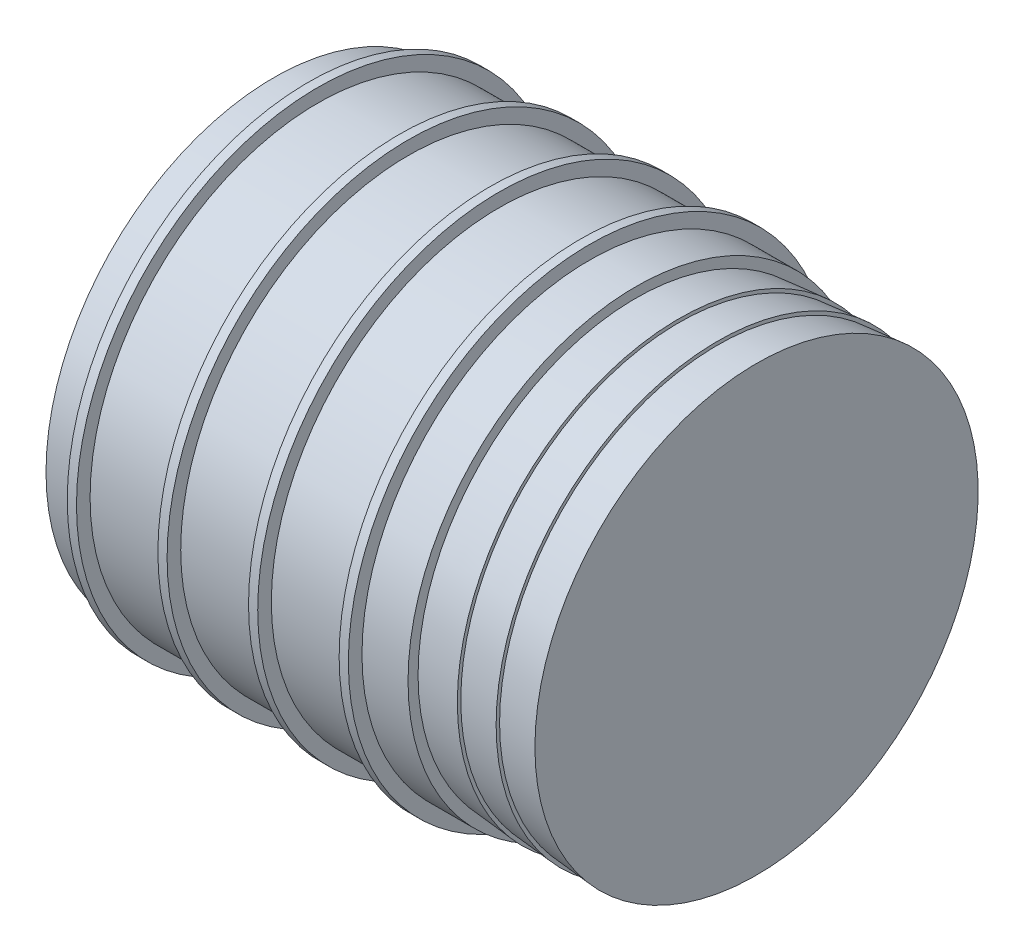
ISO-10303-21;
HEADER;
FILE_DESCRIPTION(('STEP AP214'),'2;1');
FILE_NAME('part.step','',(''),(''),'','','');
FILE_SCHEMA(('AUTOMOTIVE_DESIGN { 1 0 10303 214 1 1 1 1 }'));
ENDSEC;
DATA;
#1=APPLICATION_CONTEXT('core data for automotive mechanical design processes');
#2=APPLICATION_PROTOCOL_DEFINITION('international standard','automotive_design',2000,#1);
#3=PRODUCT_CONTEXT('',#1,'mechanical');
#4=PRODUCT('Part','Part','',(#3));
#5=PRODUCT_RELATED_PRODUCT_CATEGORY('part','',(#4));
#6=PRODUCT_DEFINITION_FORMATION('','',#4);
#7=PRODUCT_DEFINITION_CONTEXT('part definition',#1,'design');
#8=PRODUCT_DEFINITION('design','',#6,#7);
#9=PRODUCT_DEFINITION_SHAPE('','',#8);
#10=(LENGTH_UNIT() NAMED_UNIT(*) SI_UNIT(.MILLI.,.METRE.));
#11=(NAMED_UNIT(*) PLANE_ANGLE_UNIT() SI_UNIT($,.RADIAN.));
#12=(NAMED_UNIT(*) SI_UNIT($,.STERADIAN.) SOLID_ANGLE_UNIT());
#13=UNCERTAINTY_MEASURE_WITH_UNIT(LENGTH_MEASURE(1.E-05),#10,'distance_accuracy_value','');
#14=(GEOMETRIC_REPRESENTATION_CONTEXT(3) GLOBAL_UNCERTAINTY_ASSIGNED_CONTEXT((#13)) GLOBAL_UNIT_ASSIGNED_CONTEXT((#10,
#11,#12)) REPRESENTATION_CONTEXT('',''));
#15=CARTESIAN_POINT('',(0.,0.,0.));
#16=DIRECTION('',(0.,0.,1.));
#17=DIRECTION('',(1.,0.,0.));
#18=AXIS2_PLACEMENT_3D('',#15,#16,#17);
#19=CARTESIAN_POINT('',(16.,0.,0.));
#20=DIRECTION('',(1.,0.,0.));
#21=DIRECTION('',(0.,0.,-1.));
#22=AXIS2_PLACEMENT_3D('',#19,#20,#21);
#23=PLANE('',#22);
#24=CARTESIAN_POINT('',(16.,0.,0.));
#25=DIRECTION('',(-1.,0.,0.));
#26=DIRECTION('',(0.,0.,1.));
#27=AXIS2_PLACEMENT_3D('',#24,#25,#26);
#28=CIRCLE('',#27,7.34619809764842);
#29=CARTESIAN_POINT('',(16.,0.,7.34619809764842));
#30=VERTEX_POINT('',#29);
#31=EDGE_CURVE('E9',#30,#30,#28,.T.);
#32=ORIENTED_EDGE('',*,*,#31,.F.);
#33=EDGE_LOOP('',(#32));
#34=FACE_BOUND('',#33,.T.);
#35=ADVANCED_FACE('F14',(#34),#23,.T.);
#36=CARTESIAN_POINT('',(14.7144174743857,0.,0.));
#37=DIRECTION('',(1.,0.,0.));
#38=DIRECTION('',(0.,0.,-1.));
#39=AXIS2_PLACEMENT_3D('',#36,#37,#38);
#40=CONICAL_SURFACE('',#39,7.23201279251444,0.0885874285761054);
#41=ORIENTED_EDGE('',*,*,#31,.T.);
#42=EDGE_LOOP('',(#41));
#43=FACE_BOUND('',#42,.T.);
#44=CARTESIAN_POINT('',(14.7144174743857,0.,0.));
#45=DIRECTION('',(-1.,0.,0.));
#46=DIRECTION('',(0.,0.,1.));
#47=AXIS2_PLACEMENT_3D('',#44,#45,#46);
#48=CIRCLE('',#47,7.23201279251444);
#49=CARTESIAN_POINT('',(14.7144174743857,0.,7.23201279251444));
#50=VERTEX_POINT('',#49);
#51=EDGE_CURVE('E20',#50,#50,#48,.T.);
#52=ORIENTED_EDGE('',*,*,#51,.F.);
#53=EDGE_LOOP('',(#52));
#54=FACE_BOUND('',#53,.T.);
#55=ADVANCED_FACE('F146',(#43,#54),#40,.T.);
#56=CARTESIAN_POINT('',(14.7144174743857,-2.68252858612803E-12,0.));
#57=DIRECTION('',(1.,0.,0.));
#58=DIRECTION('',(0.,0.,-1.));
#59=AXIS2_PLACEMENT_3D('',#56,#57,#58);
#60=PLANE('',#59);
#61=ORIENTED_EDGE('',*,*,#51,.T.);
#62=EDGE_LOOP('',(#61));
#63=FACE_BOUND('',#62,.T.);
#64=CARTESIAN_POINT('',(14.7144174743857,0.,0.));
#65=DIRECTION('',(-1.,0.,0.));
#66=DIRECTION('',(0.,0.,1.));
#67=AXIS2_PLACEMENT_3D('',#64,#65,#66);
#68=CIRCLE('',#67,7.34619809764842);
#69=CARTESIAN_POINT('',(14.7144174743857,0.,7.34619809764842));
#70=VERTEX_POINT('',#69);
#71=EDGE_CURVE('E24',#70,#70,#68,.T.);
#72=ORIENTED_EDGE('',*,*,#71,.F.);
#73=EDGE_LOOP('',(#72));
#74=FACE_BOUND('',#73,.T.);
#75=ADVANCED_FACE('F152',(#63,#74),#60,.T.);
#76=CARTESIAN_POINT('',(13.4288349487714,0.,0.));
#77=DIRECTION('',(1.,0.,0.));
#78=DIRECTION('',(0.,0.,-1.));
#79=AXIS2_PLACEMENT_3D('',#76,#77,#78);
#80=CONICAL_SURFACE('',#79,7.23201279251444,0.0885874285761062);
#81=ORIENTED_EDGE('',*,*,#71,.T.);
#82=EDGE_LOOP('',(#81));
#83=FACE_BOUND('',#82,.T.);
#84=CARTESIAN_POINT('',(13.4288349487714,0.,0.));
#85=DIRECTION('',(-1.,0.,0.));
#86=DIRECTION('',(0.,0.,1.));
#87=AXIS2_PLACEMENT_3D('',#84,#85,#86);
#88=CIRCLE('',#87,7.23201279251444);
#89=CARTESIAN_POINT('',(13.4288349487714,0.,7.23201279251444));
#90=VERTEX_POINT('',#89);
#91=EDGE_CURVE('E28',#90,#90,#88,.T.);
#92=ORIENTED_EDGE('',*,*,#91,.F.);
#93=EDGE_LOOP('',(#92));
#94=FACE_BOUND('',#93,.T.);
#95=ADVANCED_FACE('F157',(#83,#94),#80,.T.);
#96=CARTESIAN_POINT('',(13.4288349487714,-2.44815900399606E-12,0.));
#97=DIRECTION('',(1.,0.,0.));
#98=DIRECTION('',(0.,0.,-1.));
#99=AXIS2_PLACEMENT_3D('',#96,#97,#98);
#100=PLANE('',#99);
#101=ORIENTED_EDGE('',*,*,#91,.T.);
#102=EDGE_LOOP('',(#101));
#103=FACE_BOUND('',#102,.T.);
#104=CARTESIAN_POINT('',(13.4288349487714,0.,0.));
#105=DIRECTION('',(-1.,0.,0.));
#106=DIRECTION('',(0.,0.,1.));
#107=AXIS2_PLACEMENT_3D('',#104,#105,#106);
#108=CIRCLE('',#107,7.34619809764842);
#109=CARTESIAN_POINT('',(13.4288349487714,0.,7.34619809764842));
#110=VERTEX_POINT('',#109);
#111=EDGE_CURVE('E33',#110,#110,#108,.T.);
#112=ORIENTED_EDGE('',*,*,#111,.F.);
#113=EDGE_LOOP('',(#112));
#114=FACE_BOUND('',#113,.T.);
#115=ADVANCED_FACE('F163',(#103,#114),#100,.T.);
#116=CARTESIAN_POINT('',(12.,0.,0.));
#117=DIRECTION('',(1.,0.,0.));
#118=DIRECTION('',(0.,0.,-1.));
#119=AXIS2_PLACEMENT_3D('',#116,#117,#118);
#120=CONICAL_SURFACE('',#119,7.21928912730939,0.0885874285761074);
#121=ORIENTED_EDGE('',*,*,#111,.T.);
#122=EDGE_LOOP('',(#121));
#123=FACE_BOUND('',#122,.T.);
#124=CARTESIAN_POINT('',(12.,0.,0.));
#125=DIRECTION('',(-1.,0.,0.));
#126=DIRECTION('',(0.,0.,1.));
#127=AXIS2_PLACEMENT_3D('',#124,#125,#126);
#128=CIRCLE('',#127,7.21928912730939);
#129=CARTESIAN_POINT('',(12.,0.,7.21928912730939));
#130=VERTEX_POINT('',#129);
#131=EDGE_CURVE('E36',#130,#130,#128,.T.);
#132=ORIENTED_EDGE('',*,*,#131,.F.);
#133=EDGE_LOOP('',(#132));
#134=FACE_BOUND('',#133,.T.);
#135=ADVANCED_FACE('F167',(#123,#134),#120,.T.);
#136=CARTESIAN_POINT('',(12.,0.,0.));
#137=DIRECTION('',(1.,0.,0.));
#138=DIRECTION('',(0.,0.,-1.));
#139=AXIS2_PLACEMENT_3D('',#136,#137,#138);
#140=PLANE('',#139);
#141=ORIENTED_EDGE('',*,*,#131,.T.);
#142=EDGE_LOOP('',(#141));
#143=FACE_BOUND('',#142,.T.);
#144=CARTESIAN_POINT('',(12.,0.,0.));
#145=DIRECTION('',(-1.,0.,0.));
#146=DIRECTION('',(0.,0.,1.));
#147=AXIS2_PLACEMENT_3D('',#144,#145,#146);
#148=CIRCLE('',#147,7.55178415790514);
#149=CARTESIAN_POINT('',(12.,0.,7.55178415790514));
#150=VERTEX_POINT('',#149);
#151=EDGE_CURVE('E39',#150,#150,#148,.T.);
#152=ORIENTED_EDGE('',*,*,#151,.F.);
#153=EDGE_LOOP('',(#152));
#154=FACE_BOUND('',#153,.T.);
#155=ADVANCED_FACE('F171',(#143,#154),#140,.T.);
#156=CARTESIAN_POINT('',(0.,0.,0.));
#157=DIRECTION('',(-1.,0.,0.));
#158=DIRECTION('',(0.,0.,1.));
#159=AXIS2_PLACEMENT_3D('',#156,#157,#158);
#160=CYLINDRICAL_SURFACE('',#159,7.5517841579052);
#161=CARTESIAN_POINT('',(10.4732460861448,0.,0.));
#162=DIRECTION('',(-1.,0.,0.));
#163=DIRECTION('',(0.,0.,1.));
#164=AXIS2_PLACEMENT_3D('',#161,#162,#163);
#165=CIRCLE('',#164,7.55178415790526);
#166=CARTESIAN_POINT('',(10.4732460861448,0.,7.55178415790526));
#167=VERTEX_POINT('',#166);
#168=EDGE_CURVE('E42',#167,#167,#165,.T.);
#169=ORIENTED_EDGE('',*,*,#168,.F.);
#170=EDGE_LOOP('',(#169));
#171=FACE_BOUND('',#170,.T.);
#172=ORIENTED_EDGE('',*,*,#151,.T.);
#173=EDGE_LOOP('',(#172));
#174=FACE_BOUND('',#173,.T.);
#175=ADVANCED_FACE('F175',(#171,#174),#160,.T.);
#176=CARTESIAN_POINT('',(10.4732460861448,0.,0.));
#177=DIRECTION('',(-1.,0.,0.));
#178=DIRECTION('',(0.,0.,1.));
#179=AXIS2_PLACEMENT_3D('',#176,#177,#178);
#180=CONICAL_SURFACE('',#179,7.55178415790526,1.56364643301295);
#181=CARTESIAN_POINT('',(10.4700413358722,0.,0.));
#182=DIRECTION('',(-1.,0.,0.));
#183=DIRECTION('',(0.,0.,1.));
#184=AXIS2_PLACEMENT_3D('',#181,#182,#183);
#185=CIRCLE('',#184,8.00000000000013);
#186=CARTESIAN_POINT('',(10.4700413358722,0.,8.00000000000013));
#187=VERTEX_POINT('',#186);
#188=EDGE_CURVE('E45',#187,#187,#185,.T.);
#189=ORIENTED_EDGE('',*,*,#188,.F.);
#190=EDGE_LOOP('',(#189));
#191=FACE_BOUND('',#190,.T.);
#192=ORIENTED_EDGE('',*,*,#168,.T.);
#193=EDGE_LOOP('',(#192));
#194=FACE_BOUND('',#193,.T.);
#195=ADVANCED_FACE('F179',(#191,#194),#180,.T.);
#196=CARTESIAN_POINT('',(0.,0.,0.));
#197=DIRECTION('',(-1.,0.,0.));
#198=DIRECTION('',(0.,0.,1.));
#199=AXIS2_PLACEMENT_3D('',#196,#197,#198);
#200=CYLINDRICAL_SURFACE('',#199,8.00000000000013);
#201=ORIENTED_EDGE('',*,*,#188,.T.);
#202=EDGE_LOOP('',(#201));
#203=FACE_BOUND('',#202,.T.);
#204=CARTESIAN_POINT('',(10.1646631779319,0.,0.));
#205=DIRECTION('',(-1.,0.,0.));
#206=DIRECTION('',(0.,0.,1.));
#207=AXIS2_PLACEMENT_3D('',#204,#205,#206);
#208=CIRCLE('',#207,8.00000000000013);
#209=CARTESIAN_POINT('',(10.1646631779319,0.,8.00000000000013));
#210=VERTEX_POINT('',#209);
#211=EDGE_CURVE('E48',#210,#210,#208,.T.);
#212=ORIENTED_EDGE('',*,*,#211,.F.);
#213=EDGE_LOOP('',(#212));
#214=FACE_BOUND('',#213,.T.);
#215=ADVANCED_FACE('F183',(#203,#214),#200,.T.);
#216=CARTESIAN_POINT('',(10.1614584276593,0.,0.));
#217=DIRECTION('',(1.,0.,0.));
#218=DIRECTION('',(0.,0.,-1.));
#219=AXIS2_PLACEMENT_3D('',#216,#217,#218);
#220=CONICAL_SURFACE('',#219,7.55178415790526,1.56364643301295);
#221=ORIENTED_EDGE('',*,*,#211,.T.);
#222=EDGE_LOOP('',(#221));
#223=FACE_BOUND('',#222,.T.);
#224=CARTESIAN_POINT('',(10.1614584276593,0.,0.));
#225=DIRECTION('',(-1.,0.,0.));
#226=DIRECTION('',(0.,0.,1.));
#227=AXIS2_PLACEMENT_3D('',#224,#225,#226);
#228=CIRCLE('',#227,7.55178415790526);
#229=CARTESIAN_POINT('',(10.1614584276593,0.,7.55178415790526));
#230=VERTEX_POINT('',#229);
#231=EDGE_CURVE('E51',#230,#230,#228,.T.);
#232=ORIENTED_EDGE('',*,*,#231,.F.);
#233=EDGE_LOOP('',(#232));
#234=FACE_BOUND('',#233,.T.);
#235=ADVANCED_FACE('F187',(#223,#234),#220,.T.);
#236=CARTESIAN_POINT('',(0.,0.,0.));
#237=DIRECTION('',(-1.,0.,0.));
#238=DIRECTION('',(0.,0.,1.));
#239=AXIS2_PLACEMENT_3D('',#236,#237,#238);
#240=CYLINDRICAL_SURFACE('',#239,7.55178415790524);
#241=CARTESIAN_POINT('',(7.46929094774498,0.,0.));
#242=DIRECTION('',(-1.,0.,0.));
#243=DIRECTION('',(0.,0.,1.));
#244=AXIS2_PLACEMENT_3D('',#241,#242,#243);
#245=CIRCLE('',#244,7.55178415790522);
#246=CARTESIAN_POINT('',(7.46929094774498,0.,7.55178415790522));
#247=VERTEX_POINT('',#246);
#248=EDGE_CURVE('E54',#247,#247,#245,.T.);
#249=ORIENTED_EDGE('',*,*,#248,.F.);
#250=EDGE_LOOP('',(#249));
#251=FACE_BOUND('',#250,.T.);
#252=ORIENTED_EDGE('',*,*,#231,.T.);
#253=EDGE_LOOP('',(#252));
#254=FACE_BOUND('',#253,.T.);
#255=ADVANCED_FACE('F191',(#251,#254),#240,.T.);
#256=CARTESIAN_POINT('',(7.46929094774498,0.,0.));
#257=DIRECTION('',(-1.,0.,0.));
#258=DIRECTION('',(0.,0.,1.));
#259=AXIS2_PLACEMENT_3D('',#256,#257,#258);
#260=CONICAL_SURFACE('',#259,7.55178415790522,1.56364643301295);
#261=CARTESIAN_POINT('',(7.46608619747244,0.,0.));
#262=DIRECTION('',(-1.,0.,0.));
#263=DIRECTION('',(0.,0.,1.));
#264=AXIS2_PLACEMENT_3D('',#261,#262,#263);
#265=CIRCLE('',#264,8.);
#266=CARTESIAN_POINT('',(7.46608619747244,0.,8.));
#267=VERTEX_POINT('',#266);
#268=EDGE_CURVE('E57',#267,#267,#265,.T.);
#269=ORIENTED_EDGE('',*,*,#268,.F.);
#270=EDGE_LOOP('',(#269));
#271=FACE_BOUND('',#270,.T.);
#272=ORIENTED_EDGE('',*,*,#248,.T.);
#273=EDGE_LOOP('',(#272));
#274=FACE_BOUND('',#273,.T.);
#275=ADVANCED_FACE('F195',(#271,#274),#260,.T.);
#276=CARTESIAN_POINT('',(0.,0.,0.));
#277=DIRECTION('',(-1.,0.,0.));
#278=DIRECTION('',(0.,0.,1.));
#279=AXIS2_PLACEMENT_3D('',#276,#277,#278);
#280=CYLINDRICAL_SURFACE('',#279,8.);
#281=ORIENTED_EDGE('',*,*,#268,.T.);
#282=EDGE_LOOP('',(#281));
#283=FACE_BOUND('',#282,.T.);
#284=CARTESIAN_POINT('',(7.16070803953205,0.,0.));
#285=DIRECTION('',(-1.,0.,0.));
#286=DIRECTION('',(0.,0.,1.));
#287=AXIS2_PLACEMENT_3D('',#284,#285,#286);
#288=CIRCLE('',#287,8.);
#289=CARTESIAN_POINT('',(7.16070803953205,0.,8.));
#290=VERTEX_POINT('',#289);
#291=EDGE_CURVE('E60',#290,#290,#288,.T.);
#292=ORIENTED_EDGE('',*,*,#291,.F.);
#293=EDGE_LOOP('',(#292));
#294=FACE_BOUND('',#293,.T.);
#295=ADVANCED_FACE('F199',(#283,#294),#280,.T.);
#296=CARTESIAN_POINT('',(7.15750328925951,0.,0.));
#297=DIRECTION('',(1.,0.,0.));
#298=DIRECTION('',(0.,0.,-1.));
#299=AXIS2_PLACEMENT_3D('',#296,#297,#298);
#300=CONICAL_SURFACE('',#299,7.55178415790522,1.56364643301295);
#301=ORIENTED_EDGE('',*,*,#291,.T.);
#302=EDGE_LOOP('',(#301));
#303=FACE_BOUND('',#302,.T.);
#304=CARTESIAN_POINT('',(7.15750328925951,0.,0.));
#305=DIRECTION('',(-1.,0.,0.));
#306=DIRECTION('',(0.,0.,1.));
#307=AXIS2_PLACEMENT_3D('',#304,#305,#306);
#308=CIRCLE('',#307,7.55178415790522);
#309=CARTESIAN_POINT('',(7.15750328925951,0.,7.55178415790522));
#310=VERTEX_POINT('',#309);
#311=EDGE_CURVE('E63',#310,#310,#308,.T.);
#312=ORIENTED_EDGE('',*,*,#311,.F.);
#313=EDGE_LOOP('',(#312));
#314=FACE_BOUND('',#313,.T.);
#315=ADVANCED_FACE('F203',(#303,#314),#300,.T.);
#316=CARTESIAN_POINT('',(0.,0.,0.));
#317=DIRECTION('',(-1.,0.,0.));
#318=DIRECTION('',(0.,0.,1.));
#319=AXIS2_PLACEMENT_3D('',#316,#317,#318);
#320=CYLINDRICAL_SURFACE('',#319,7.5517841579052);
#321=CARTESIAN_POINT('',(4.46533580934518,0.,0.));
#322=DIRECTION('',(-1.,0.,0.));
#323=DIRECTION('',(0.,0.,1.));
#324=AXIS2_PLACEMENT_3D('',#321,#322,#323);
#325=CIRCLE('',#324,7.55178415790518);
#326=CARTESIAN_POINT('',(4.46533580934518,0.,7.55178415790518));
#327=VERTEX_POINT('',#326);
#328=EDGE_CURVE('E66',#327,#327,#325,.T.);
#329=ORIENTED_EDGE('',*,*,#328,.F.);
#330=EDGE_LOOP('',(#329));
#331=FACE_BOUND('',#330,.T.);
#332=ORIENTED_EDGE('',*,*,#311,.T.);
#333=EDGE_LOOP('',(#332));
#334=FACE_BOUND('',#333,.T.);
#335=ADVANCED_FACE('F207',(#331,#334),#320,.T.);
#336=CARTESIAN_POINT('',(4.46533580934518,0.,0.));
#337=DIRECTION('',(-1.,0.,0.));
#338=DIRECTION('',(0.,0.,1.));
#339=AXIS2_PLACEMENT_3D('',#336,#337,#338);
#340=CONICAL_SURFACE('',#339,7.55178415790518,1.56364643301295);
#341=CARTESIAN_POINT('',(4.46213105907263,0.,0.));
#342=DIRECTION('',(-1.,0.,0.));
#343=DIRECTION('',(0.,0.,1.));
#344=AXIS2_PLACEMENT_3D('',#341,#342,#343);
#345=CIRCLE('',#344,8.);
#346=CARTESIAN_POINT('',(4.46213105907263,0.,8.));
#347=VERTEX_POINT('',#346);
#348=EDGE_CURVE('E69',#347,#347,#345,.T.);
#349=ORIENTED_EDGE('',*,*,#348,.F.);
#350=EDGE_LOOP('',(#349));
#351=FACE_BOUND('',#350,.T.);
#352=ORIENTED_EDGE('',*,*,#328,.T.);
#353=EDGE_LOOP('',(#352));
#354=FACE_BOUND('',#353,.T.);
#355=ADVANCED_FACE('F211',(#351,#354),#340,.T.);
#356=CARTESIAN_POINT('',(0.,0.,0.));
#357=DIRECTION('',(-1.,0.,0.));
#358=DIRECTION('',(0.,0.,1.));
#359=AXIS2_PLACEMENT_3D('',#356,#357,#358);
#360=CYLINDRICAL_SURFACE('',#359,8.);
#361=ORIENTED_EDGE('',*,*,#348,.T.);
#362=EDGE_LOOP('',(#361));
#363=FACE_BOUND('',#362,.T.);
#364=CARTESIAN_POINT('',(4.15675290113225,0.,0.));
#365=DIRECTION('',(-1.,0.,0.));
#366=DIRECTION('',(0.,0.,1.));
#367=AXIS2_PLACEMENT_3D('',#364,#365,#366);
#368=CIRCLE('',#367,8.);
#369=CARTESIAN_POINT('',(4.15675290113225,0.,8.));
#370=VERTEX_POINT('',#369);
#371=EDGE_CURVE('E72',#370,#370,#368,.T.);
#372=ORIENTED_EDGE('',*,*,#371,.F.);
#373=EDGE_LOOP('',(#372));
#374=FACE_BOUND('',#373,.T.);
#375=ADVANCED_FACE('F215',(#363,#374),#360,.T.);
#376=CARTESIAN_POINT('',(4.1535481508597,0.,0.));
#377=DIRECTION('',(1.,0.,0.));
#378=DIRECTION('',(0.,0.,-1.));
#379=AXIS2_PLACEMENT_3D('',#376,#377,#378);
#380=CONICAL_SURFACE('',#379,7.55178415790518,1.56364643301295);
#381=ORIENTED_EDGE('',*,*,#371,.T.);
#382=EDGE_LOOP('',(#381));
#383=FACE_BOUND('',#382,.T.);
#384=CARTESIAN_POINT('',(4.1535481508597,0.,0.));
#385=DIRECTION('',(-1.,0.,0.));
#386=DIRECTION('',(0.,0.,1.));
#387=AXIS2_PLACEMENT_3D('',#384,#385,#386);
#388=CIRCLE('',#387,7.55178415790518);
#389=CARTESIAN_POINT('',(4.1535481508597,0.,7.55178415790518));
#390=VERTEX_POINT('',#389);
#391=EDGE_CURVE('E75',#390,#390,#388,.T.);
#392=ORIENTED_EDGE('',*,*,#391,.F.);
#393=EDGE_LOOP('',(#392));
#394=FACE_BOUND('',#393,.T.);
#395=ADVANCED_FACE('F219',(#383,#394),#380,.T.);
#396=CARTESIAN_POINT('',(0.,0.,0.));
#397=DIRECTION('',(-1.,0.,0.));
#398=DIRECTION('',(0.,0.,1.));
#399=AXIS2_PLACEMENT_3D('',#396,#397,#398);
#400=CYLINDRICAL_SURFACE('',#399,7.55178415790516);
#401=CARTESIAN_POINT('',(1.46138067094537,0.,0.));
#402=DIRECTION('',(-1.,0.,0.));
#403=DIRECTION('',(0.,0.,1.));
#404=AXIS2_PLACEMENT_3D('',#401,#402,#403);
#405=CIRCLE('',#404,7.55178415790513);
#406=CARTESIAN_POINT('',(1.46138067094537,0.,7.55178415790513));
#407=VERTEX_POINT('',#406);
#408=EDGE_CURVE('E78',#407,#407,#405,.T.);
#409=ORIENTED_EDGE('',*,*,#408,.F.);
#410=EDGE_LOOP('',(#409));
#411=FACE_BOUND('',#410,.T.);
#412=ORIENTED_EDGE('',*,*,#391,.T.);
#413=EDGE_LOOP('',(#412));
#414=FACE_BOUND('',#413,.T.);
#415=ADVANCED_FACE('F223',(#411,#414),#400,.T.);
#416=CARTESIAN_POINT('',(1.46138067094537,0.,0.));
#417=DIRECTION('',(-1.,0.,0.));
#418=DIRECTION('',(0.,0.,1.));
#419=AXIS2_PLACEMENT_3D('',#416,#417,#418);
#420=CONICAL_SURFACE('',#419,7.55178415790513,1.56364643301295);
#421=CARTESIAN_POINT('',(1.45817592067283,0.,0.));
#422=DIRECTION('',(-1.,0.,0.));
#423=DIRECTION('',(0.,0.,1.));
#424=AXIS2_PLACEMENT_3D('',#421,#422,#423);
#425=CIRCLE('',#424,8.);
#426=CARTESIAN_POINT('',(1.45817592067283,0.,8.));
#427=VERTEX_POINT('',#426);
#428=EDGE_CURVE('E81',#427,#427,#425,.T.);
#429=ORIENTED_EDGE('',*,*,#428,.F.);
#430=EDGE_LOOP('',(#429));
#431=FACE_BOUND('',#430,.T.);
#432=ORIENTED_EDGE('',*,*,#408,.T.);
#433=EDGE_LOOP('',(#432));
#434=FACE_BOUND('',#433,.T.);
#435=ADVANCED_FACE('F227',(#431,#434),#420,.T.);
#436=CARTESIAN_POINT('',(0.,0.,0.));
#437=DIRECTION('',(-1.,0.,0.));
#438=DIRECTION('',(0.,0.,1.));
#439=AXIS2_PLACEMENT_3D('',#436,#437,#438);
#440=CYLINDRICAL_SURFACE('',#439,8.);
#441=ORIENTED_EDGE('',*,*,#428,.T.);
#442=EDGE_LOOP('',(#441));
#443=FACE_BOUND('',#442,.T.);
#444=CARTESIAN_POINT('',(1.15279776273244,0.,0.));
#445=DIRECTION('',(-1.,0.,0.));
#446=DIRECTION('',(0.,0.,1.));
#447=AXIS2_PLACEMENT_3D('',#444,#445,#446);
#448=CIRCLE('',#447,8.);
#449=CARTESIAN_POINT('',(1.15279776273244,0.,8.));
#450=VERTEX_POINT('',#449);
#451=EDGE_CURVE('E84',#450,#450,#448,.T.);
#452=ORIENTED_EDGE('',*,*,#451,.F.);
#453=EDGE_LOOP('',(#452));
#454=FACE_BOUND('',#453,.T.);
#455=ADVANCED_FACE('F142',(#443,#454),#440,.T.);
#456=CARTESIAN_POINT('',(1.1495930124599,0.,0.));
#457=DIRECTION('',(1.,0.,0.));
#458=DIRECTION('',(0.,0.,-1.));
#459=AXIS2_PLACEMENT_3D('',#456,#457,#458);
#460=CONICAL_SURFACE('',#459,7.55178415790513,1.56364643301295);
#461=ORIENTED_EDGE('',*,*,#451,.T.);
#462=EDGE_LOOP('',(#461));
#463=FACE_BOUND('',#462,.T.);
#464=CARTESIAN_POINT('',(1.1495930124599,0.,0.));
#465=DIRECTION('',(-1.,0.,0.));
#466=DIRECTION('',(0.,0.,1.));
#467=AXIS2_PLACEMENT_3D('',#464,#465,#466);
#468=CIRCLE('',#467,7.55178415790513);
#469=CARTESIAN_POINT('',(1.1495930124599,0.,7.55178415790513));
#470=VERTEX_POINT('',#469);
#471=EDGE_CURVE('E87',#470,#470,#468,.T.);
#472=ORIENTED_EDGE('',*,*,#471,.F.);
#473=EDGE_LOOP('',(#472));
#474=FACE_BOUND('',#473,.T.);
#475=ADVANCED_FACE('F134',(#463,#474),#460,.T.);
#476=CARTESIAN_POINT('',(0.,0.,0.));
#477=DIRECTION('',(-1.,0.,0.));
#478=DIRECTION('',(0.,0.,1.));
#479=AXIS2_PLACEMENT_3D('',#476,#477,#478);
#480=CYLINDRICAL_SURFACE('',#479,7.55178415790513);
#481=ORIENTED_EDGE('',*,*,#471,.T.);
#482=EDGE_LOOP('',(#481));
#483=FACE_BOUND('',#482,.T.);
#484=CARTESIAN_POINT('',(0.,0.,0.));
#485=DIRECTION('',(-1.,0.,0.));
#486=DIRECTION('',(0.,0.,1.));
#487=AXIS2_PLACEMENT_3D('',#484,#485,#486);
#488=CIRCLE('',#487,7.55178415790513);
#489=CARTESIAN_POINT('',(0.,0.,7.55178415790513));
#490=VERTEX_POINT('',#489);
#491=EDGE_CURVE('E90',#490,#490,#488,.T.);
#492=ORIENTED_EDGE('',*,*,#491,.F.);
#493=EDGE_LOOP('',(#492));
#494=FACE_BOUND('',#493,.T.);
#495=ADVANCED_FACE('F129',(#483,#494),#480,.T.);
#496=CARTESIAN_POINT('',(0.,0.,0.));
#497=DIRECTION('',(-1.,0.,0.));
#498=DIRECTION('',(0.,0.,1.));
#499=AXIS2_PLACEMENT_3D('',#496,#497,#498);
#500=PLANE('',#499);
#501=CARTESIAN_POINT('',(0.,0.,0.));
#502=DIRECTION('',(-1.,0.,0.));
#503=DIRECTION('',(0.,0.,1.));
#504=AXIS2_PLACEMENT_3D('',#501,#502,#503);
#505=CIRCLE('',#504,7.);
#506=CARTESIAN_POINT('',(0.,0.,7.));
#507=VERTEX_POINT('',#506);
#508=EDGE_CURVE('E96',#507,#507,#505,.T.);
#509=ORIENTED_EDGE('',*,*,#508,.F.);
#510=EDGE_LOOP('',(#509));
#511=FACE_BOUND('',#510,.T.);
#512=ORIENTED_EDGE('',*,*,#491,.T.);
#513=EDGE_LOOP('',(#512));
#514=FACE_BOUND('',#513,.T.);
#515=ADVANCED_FACE('F123',(#511,#514),#500,.T.);
#516=CARTESIAN_POINT('',(0.,0.,0.));
#517=DIRECTION('',(-1.,0.,0.));
#518=DIRECTION('',(0.,0.,1.));
#519=AXIS2_PLACEMENT_3D('',#516,#517,#518);
#520=CONICAL_SURFACE('',#519,7.,0.0349065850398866);
#521=CARTESIAN_POINT('',(2.,0.,0.));
#522=DIRECTION('',(-1.,0.,0.));
#523=DIRECTION('',(0.,0.,1.));
#524=AXIS2_PLACEMENT_3D('',#521,#522,#523);
#525=CIRCLE('',#524,6.9301584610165);
#526=CARTESIAN_POINT('',(2.,0.,6.9301584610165));
#527=VERTEX_POINT('',#526);
#528=EDGE_CURVE('E93',#527,#527,#525,.T.);
#529=ORIENTED_EDGE('',*,*,#528,.F.);
#530=EDGE_LOOP('',(#529));
#531=FACE_BOUND('',#530,.T.);
#532=ORIENTED_EDGE('',*,*,#508,.T.);
#533=EDGE_LOOP('',(#532));
#534=FACE_BOUND('',#533,.T.);
#535=ADVANCED_FACE('F117',(#531,#534),#520,.F.);
#536=CARTESIAN_POINT('',(2.,0.,0.));
#537=DIRECTION('',(-1.,0.,0.));
#538=DIRECTION('',(0.,0.,1.));
#539=AXIS2_PLACEMENT_3D('',#536,#537,#538);
#540=PLANE('',#539);
#541=CARTESIAN_POINT('',(2.,0.,0.));
#542=DIRECTION('',(-1.,0.,0.));
#543=DIRECTION('',(0.,0.,1.));
#544=AXIS2_PLACEMENT_3D('',#541,#542,#543);
#545=CIRCLE('',#544,4.);
#546=CARTESIAN_POINT('',(2.,0.,4.));
#547=VERTEX_POINT('',#546);
#548=EDGE_CURVE('E100',#547,#547,#545,.T.);
#549=ORIENTED_EDGE('',*,*,#548,.F.);
#550=EDGE_LOOP('',(#549));
#551=FACE_BOUND('',#550,.T.);
#552=ORIENTED_EDGE('',*,*,#528,.T.);
#553=EDGE_LOOP('',(#552));
#554=FACE_BOUND('',#553,.T.);
#555=ADVANCED_FACE('F111',(#551,#554),#540,.T.);
#556=CARTESIAN_POINT('',(6.,0.,0.));
#557=DIRECTION('',(-1.,0.,0.));
#558=DIRECTION('',(0.,0.,1.));
#559=AXIS2_PLACEMENT_3D('',#556,#557,#558);
#560=CYLINDRICAL_SURFACE('',#559,4.);
#561=CARTESIAN_POINT('',(6.,0.,0.));
#562=DIRECTION('',(-1.,0.,0.));
#563=DIRECTION('',(0.,0.,1.));
#564=AXIS2_PLACEMENT_3D('',#561,#562,#563);
#565=CIRCLE('',#564,4.);
#566=CARTESIAN_POINT('',(6.,0.,4.));
#567=VERTEX_POINT('',#566);
#568=EDGE_CURVE('E99',#567,#567,#565,.T.);
#569=ORIENTED_EDGE('',*,*,#568,.F.);
#570=EDGE_LOOP('',(#569));
#571=FACE_BOUND('',#570,.T.);
#572=ORIENTED_EDGE('',*,*,#548,.T.);
#573=EDGE_LOOP('',(#572));
#574=FACE_BOUND('',#573,.T.);
#575=ADVANCED_FACE('F108',(#571,#574),#560,.F.);
#576=CARTESIAN_POINT('',(6.,0.,0.));
#577=DIRECTION('',(-1.,0.,0.));
#578=DIRECTION('',(0.,0.,1.));
#579=AXIS2_PLACEMENT_3D('',#576,#577,#578);
#580=PLANE('',#579);
#581=ORIENTED_EDGE('',*,*,#568,.T.);
#582=EDGE_LOOP('',(#581));
#583=FACE_BOUND('',#582,.T.);
#584=ADVANCED_FACE('F106',(#583),#580,.T.);
#585=CLOSED_SHELL('',(#35,#55,#75,#95,#115,#135,#155,#175,#195,#215,#235,#255,#275,#295,#315,
#335,#355,#375,#395,#415,#435,#455,#475,#495,#515,#535,#555,#575,#584));
#586=MANIFOLD_SOLID_BREP('B1',#585);
#587=ADVANCED_BREP_SHAPE_REPRESENTATION('',(#18,#586),#14);
#588=SHAPE_DEFINITION_REPRESENTATION(#9,#587);
ENDSEC;
END-ISO-10303-21;
